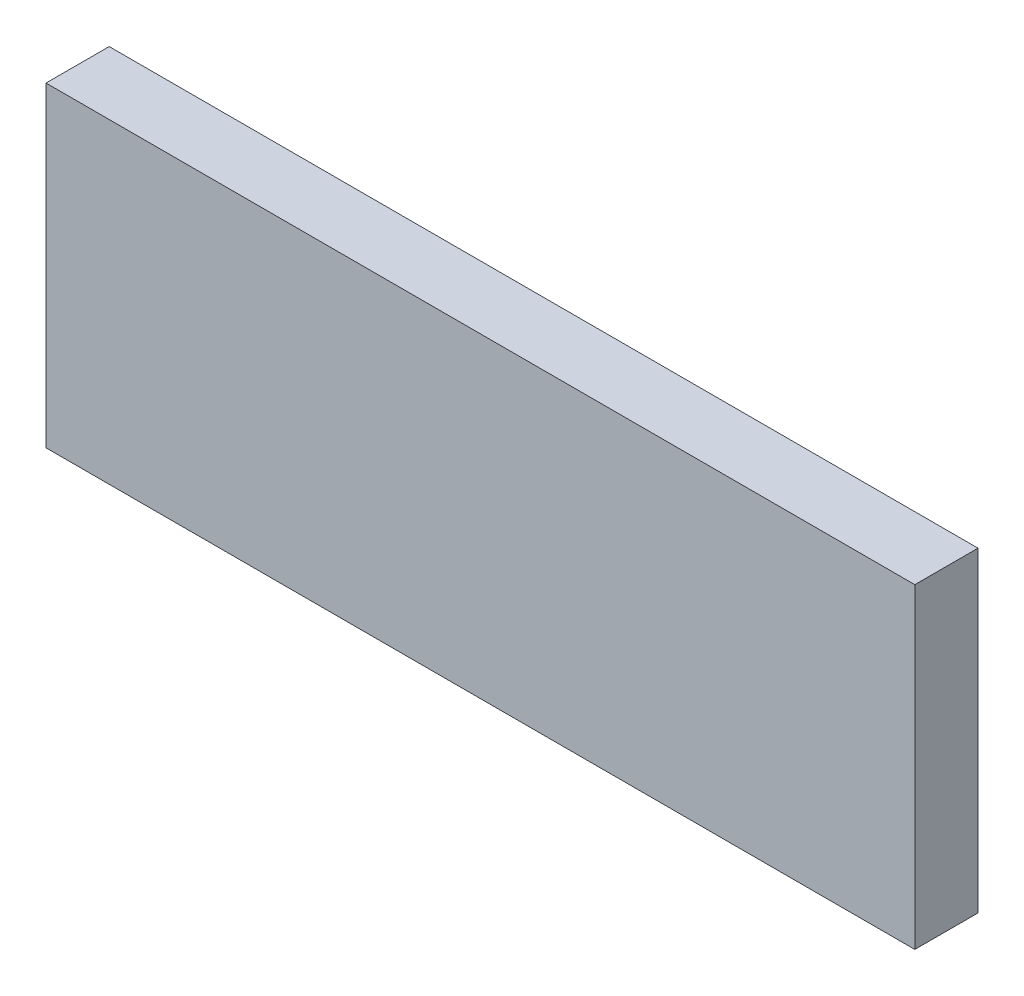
ISO-10303-21;
HEADER;
FILE_DESCRIPTION(('STEP AP214'),'2;1');
FILE_NAME('part.step','',(''),(''),'','','');
FILE_SCHEMA(('AUTOMOTIVE_DESIGN { 1 0 10303 214 1 1 1 1 }'));
ENDSEC;
DATA;
#1=APPLICATION_CONTEXT('core data for automotive mechanical design processes');
#2=APPLICATION_PROTOCOL_DEFINITION('international standard','automotive_design',2000,#1);
#3=PRODUCT_CONTEXT('',#1,'mechanical');
#4=PRODUCT('Part','Part','',(#3));
#5=PRODUCT_RELATED_PRODUCT_CATEGORY('part','',(#4));
#6=PRODUCT_DEFINITION_FORMATION('','',#4);
#7=PRODUCT_DEFINITION_CONTEXT('part definition',#1,'design');
#8=PRODUCT_DEFINITION('design','',#6,#7);
#9=PRODUCT_DEFINITION_SHAPE('','',#8);
#10=(LENGTH_UNIT() NAMED_UNIT(*) SI_UNIT(.MILLI.,.METRE.));
#11=(NAMED_UNIT(*) PLANE_ANGLE_UNIT() SI_UNIT($,.RADIAN.));
#12=(NAMED_UNIT(*) SI_UNIT($,.STERADIAN.) SOLID_ANGLE_UNIT());
#13=UNCERTAINTY_MEASURE_WITH_UNIT(LENGTH_MEASURE(1.E-05),#10,'distance_accuracy_value','');
#14=(GEOMETRIC_REPRESENTATION_CONTEXT(3) GLOBAL_UNCERTAINTY_ASSIGNED_CONTEXT((#13)) GLOBAL_UNIT_ASSIGNED_CONTEXT((#10,
#11,#12)) REPRESENTATION_CONTEXT('',''));
#15=CARTESIAN_POINT('',(0.,0.,0.));
#16=DIRECTION('',(0.,0.,1.));
#17=DIRECTION('',(1.,0.,0.));
#18=AXIS2_PLACEMENT_3D('',#15,#16,#17);
#19=CARTESIAN_POINT('',(0.,0.,8.));
#20=DIRECTION('',(1.,0.,0.));
#21=DIRECTION('',(0.,0.,-1.));
#22=AXIS2_PLACEMENT_3D('',#19,#20,#21);
#23=PLANE('',#22);
#24=DIRECTION('',(0.,-1.,0.));
#25=VECTOR('',#24,1.);
#26=CARTESIAN_POINT('',(0.,0.,0.));
#27=LINE('',#26,#25);
#28=CARTESIAN_POINT('',(0.,40.,0.));
#29=VERTEX_POINT('',#28);
#30=CARTESIAN_POINT('',(0.,0.,0.));
#31=VERTEX_POINT('',#30);
#32=EDGE_CURVE('E105',#29,#31,#27,.T.);
#33=ORIENTED_EDGE('',*,*,#32,.T.);
#34=DIRECTION('',(0.,0.,-1.));
#35=VECTOR('',#34,1.);
#36=CARTESIAN_POINT('',(0.,0.,8.));
#37=LINE('',#36,#35);
#38=CARTESIAN_POINT('',(0.,0.,8.));
#39=VERTEX_POINT('',#38);
#40=EDGE_CURVE('E11',#39,#31,#37,.T.);
#41=ORIENTED_EDGE('',*,*,#40,.F.);
#42=DIRECTION('',(0.,-1.,0.));
#43=VECTOR('',#42,1.);
#44=CARTESIAN_POINT('',(0.,0.,8.));
#45=LINE('',#44,#43);
#46=CARTESIAN_POINT('',(0.,40.,8.));
#47=VERTEX_POINT('',#46);
#48=EDGE_CURVE('E88',#47,#39,#45,.T.);
#49=ORIENTED_EDGE('',*,*,#48,.F.);
#50=DIRECTION('',(0.,0.,-1.));
#51=VECTOR('',#50,1.);
#52=CARTESIAN_POINT('',(0.,40.,8.));
#53=LINE('',#52,#51);
#54=EDGE_CURVE('E101',#47,#29,#53,.T.);
#55=ORIENTED_EDGE('',*,*,#54,.T.);
#56=EDGE_LOOP('',(#33,#41,#49,#55));
#57=FACE_BOUND('',#56,.T.);
#58=ADVANCED_FACE('F36',(#57),#23,.F.);
#59=CARTESIAN_POINT('',(0.,0.,8.));
#60=DIRECTION('',(0.,1.,0.));
#61=DIRECTION('',(0.,0.,1.));
#62=AXIS2_PLACEMENT_3D('',#59,#60,#61);
#63=PLANE('',#62);
#64=DIRECTION('',(1.,0.,0.));
#65=VECTOR('',#64,1.);
#66=CARTESIAN_POINT('',(0.,0.,0.));
#67=LINE('',#66,#65);
#68=CARTESIAN_POINT('',(110.,0.,0.));
#69=VERTEX_POINT('',#68);
#70=EDGE_CURVE('E93',#31,#69,#67,.T.);
#71=ORIENTED_EDGE('',*,*,#70,.T.);
#72=DIRECTION('',(0.,0.,-1.));
#73=VECTOR('',#72,1.);
#74=CARTESIAN_POINT('',(110.,0.,8.));
#75=LINE('',#74,#73);
#76=CARTESIAN_POINT('',(110.,0.,8.));
#77=VERTEX_POINT('',#76);
#78=EDGE_CURVE('E45',#77,#69,#75,.T.);
#79=ORIENTED_EDGE('',*,*,#78,.F.);
#80=DIRECTION('',(1.,0.,0.));
#81=VECTOR('',#80,1.);
#82=CARTESIAN_POINT('',(0.,0.,8.));
#83=LINE('',#82,#81);
#84=EDGE_CURVE('E83',#39,#77,#83,.T.);
#85=ORIENTED_EDGE('',*,*,#84,.F.);
#86=ORIENTED_EDGE('',*,*,#40,.T.);
#87=EDGE_LOOP('',(#71,#79,#85,#86));
#88=FACE_BOUND('',#87,.T.);
#89=ADVANCED_FACE('F92',(#88),#63,.F.);
#90=CARTESIAN_POINT('',(110.,0.,8.));
#91=DIRECTION('',(-1.,0.,0.));
#92=DIRECTION('',(0.,0.,1.));
#93=AXIS2_PLACEMENT_3D('',#90,#91,#92);
#94=PLANE('',#93);
#95=DIRECTION('',(0.,1.,0.));
#96=VECTOR('',#95,1.);
#97=CARTESIAN_POINT('',(110.,0.,0.));
#98=LINE('',#97,#96);
#99=CARTESIAN_POINT('',(110.,40.,0.));
#100=VERTEX_POINT('',#99);
#101=EDGE_CURVE('E70',#69,#100,#98,.T.);
#102=ORIENTED_EDGE('',*,*,#101,.T.);
#103=DIRECTION('',(0.,0.,-1.));
#104=VECTOR('',#103,1.);
#105=CARTESIAN_POINT('',(110.,40.,8.));
#106=LINE('',#105,#104);
#107=CARTESIAN_POINT('',(110.,40.,8.));
#108=VERTEX_POINT('',#107);
#109=EDGE_CURVE('E95',#108,#100,#106,.T.);
#110=ORIENTED_EDGE('',*,*,#109,.F.);
#111=DIRECTION('',(0.,1.,0.));
#112=VECTOR('',#111,1.);
#113=CARTESIAN_POINT('',(110.,0.,8.));
#114=LINE('',#113,#112);
#115=EDGE_CURVE('E86',#77,#108,#114,.T.);
#116=ORIENTED_EDGE('',*,*,#115,.F.);
#117=ORIENTED_EDGE('',*,*,#78,.T.);
#118=EDGE_LOOP('',(#102,#110,#116,#117));
#119=FACE_BOUND('',#118,.T.);
#120=ADVANCED_FACE('F96',(#119),#94,.F.);
#121=CARTESIAN_POINT('',(0.,40.,8.));
#122=DIRECTION('',(0.,-1.,0.));
#123=DIRECTION('',(0.,0.,-1.));
#124=AXIS2_PLACEMENT_3D('',#121,#122,#123);
#125=PLANE('',#124);
#126=DIRECTION('',(-1.,0.,0.));
#127=VECTOR('',#126,1.);
#128=CARTESIAN_POINT('',(0.,40.,0.));
#129=LINE('',#128,#127);
#130=EDGE_CURVE('E76',#100,#29,#129,.T.);
#131=ORIENTED_EDGE('',*,*,#130,.T.);
#132=ORIENTED_EDGE('',*,*,#54,.F.);
#133=DIRECTION('',(-1.,0.,0.));
#134=VECTOR('',#133,1.);
#135=CARTESIAN_POINT('',(0.,40.,8.));
#136=LINE('',#135,#134);
#137=EDGE_CURVE('E53',#108,#47,#136,.T.);
#138=ORIENTED_EDGE('',*,*,#137,.F.);
#139=ORIENTED_EDGE('',*,*,#109,.T.);
#140=EDGE_LOOP('',(#131,#132,#138,#139));
#141=FACE_BOUND('',#140,.T.);
#142=ADVANCED_FACE('F118',(#141),#125,.F.);
#143=CARTESIAN_POINT('',(0.,40.,8.));
#144=DIRECTION('',(0.,0.,-1.));
#145=DIRECTION('',(-1.,0.,0.));
#146=AXIS2_PLACEMENT_3D('',#143,#144,#145);
#147=PLANE('',#146);
#148=ORIENTED_EDGE('',*,*,#48,.T.);
#149=ORIENTED_EDGE('',*,*,#84,.T.);
#150=ORIENTED_EDGE('',*,*,#115,.T.);
#151=ORIENTED_EDGE('',*,*,#137,.T.);
#152=EDGE_LOOP('',(#148,#149,#150,#151));
#153=FACE_BOUND('',#152,.T.);
#154=ADVANCED_FACE('F84',(#153),#147,.F.);
#155=CARTESIAN_POINT('',(0.,40.,0.));
#156=DIRECTION('',(0.,0.,-1.));
#157=DIRECTION('',(-1.,0.,0.));
#158=AXIS2_PLACEMENT_3D('',#155,#156,#157);
#159=PLANE('',#158);
#160=ORIENTED_EDGE('',*,*,#32,.F.);
#161=ORIENTED_EDGE('',*,*,#130,.F.);
#162=ORIENTED_EDGE('',*,*,#101,.F.);
#163=ORIENTED_EDGE('',*,*,#70,.F.);
#164=EDGE_LOOP('',(#160,#161,#162,#163));
#165=FACE_BOUND('',#164,.T.);
#166=ADVANCED_FACE('F121',(#165),#159,.T.);
#167=CLOSED_SHELL('',(#58,#89,#120,#142,#154,#166));
#168=MANIFOLD_SOLID_BREP('B2',#167);
#169=ADVANCED_BREP_SHAPE_REPRESENTATION('',(#18,#168),#14);
#170=SHAPE_DEFINITION_REPRESENTATION(#9,#169);
ENDSEC;
END-ISO-10303-21;
